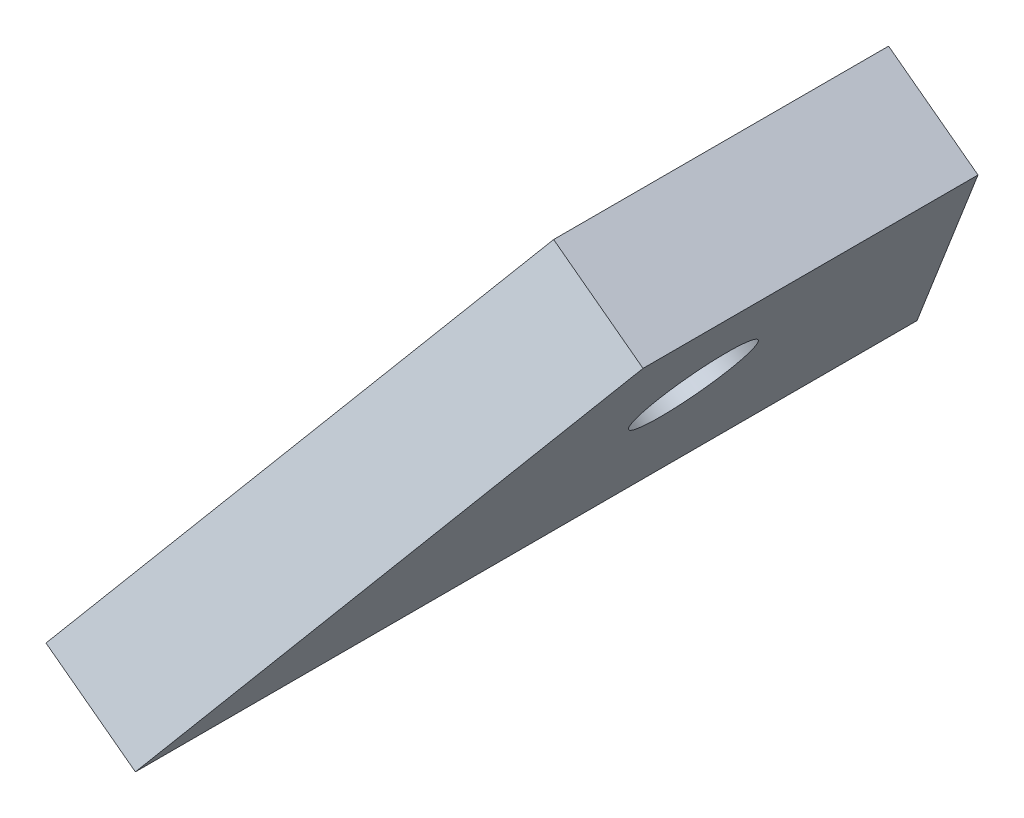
ISO-10303-21;
HEADER;
FILE_DESCRIPTION(('STEP AP214'),'2;1');
FILE_NAME('part.step','',(''),(''),'','','');
FILE_SCHEMA(('AUTOMOTIVE_DESIGN { 1 0 10303 214 1 1 1 1 }'));
ENDSEC;
DATA;
#1=APPLICATION_CONTEXT('core data for automotive mechanical design processes');
#2=APPLICATION_PROTOCOL_DEFINITION('international standard','automotive_design',2000,#1);
#3=PRODUCT_CONTEXT('',#1,'mechanical');
#4=PRODUCT('Part','Part','',(#3));
#5=PRODUCT_RELATED_PRODUCT_CATEGORY('part','',(#4));
#6=PRODUCT_DEFINITION_FORMATION('','',#4);
#7=PRODUCT_DEFINITION_CONTEXT('part definition',#1,'design');
#8=PRODUCT_DEFINITION('design','',#6,#7);
#9=PRODUCT_DEFINITION_SHAPE('','',#8);
#10=(LENGTH_UNIT() NAMED_UNIT(*) SI_UNIT(.MILLI.,.METRE.));
#11=(NAMED_UNIT(*) PLANE_ANGLE_UNIT() SI_UNIT($,.RADIAN.));
#12=(NAMED_UNIT(*) SI_UNIT($,.STERADIAN.) SOLID_ANGLE_UNIT());
#13=UNCERTAINTY_MEASURE_WITH_UNIT(LENGTH_MEASURE(1.E-05),#10,'distance_accuracy_value','');
#14=(GEOMETRIC_REPRESENTATION_CONTEXT(3) GLOBAL_UNCERTAINTY_ASSIGNED_CONTEXT((#13)) GLOBAL_UNIT_ASSIGNED_CONTEXT((#10,
#11,#12)) REPRESENTATION_CONTEXT('',''));
#15=CARTESIAN_POINT('',(0.,0.,0.));
#16=DIRECTION('',(0.,0.,1.));
#17=DIRECTION('',(1.,0.,0.));
#18=AXIS2_PLACEMENT_3D('',#15,#16,#17);
#19=CARTESIAN_POINT('',(-189.838837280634,417.784939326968,-6.));
#20=DIRECTION('',(-0.255106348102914,-0.340916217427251,0.904818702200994));
#21=DIRECTION('',(0.,-0.935780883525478,-0.35258210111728));
#22=AXIS2_PLACEMENT_3D('',#19,#20,#21);
#23=PLANE('',#22);
#24=DIRECTION('',(-0.542100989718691,-0.724446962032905,-0.425797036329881));
#25=VECTOR('',#24,1.);
#26=CARTESIAN_POINT('',(-186.636220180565,415.388432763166,-6.));
#27=LINE('',#26,#25);
#28=CARTESIAN_POINT('',(-186.636220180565,415.388432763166,-6.));
#29=VERTEX_POINT('',#28);
#30=CARTESIAN_POINT('',(-196.82137307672,401.777310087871,-14.));
#31=VERTEX_POINT('',#30);
#32=EDGE_CURVE('E105',#29,#31,#27,.T.);
#33=ORIENTED_EDGE('',*,*,#32,.T.);
#34=DIRECTION('',(0.800654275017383,-0.599126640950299,0.));
#35=VECTOR('',#34,1.);
#36=CARTESIAN_POINT('',(-200.02399017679,404.173816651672,-14.));
#37=LINE('',#36,#35);
#38=CARTESIAN_POINT('',(-200.02399017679,404.173816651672,-14.));
#39=VERTEX_POINT('',#38);
#40=EDGE_CURVE('E12',#39,#31,#37,.T.);
#41=ORIENTED_EDGE('',*,*,#40,.F.);
#42=DIRECTION('',(-0.542100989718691,-0.724446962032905,-0.425797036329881));
#43=VECTOR('',#42,1.);
#44=CARTESIAN_POINT('',(-189.838837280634,417.784939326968,-6.));
#45=LINE('',#44,#43);
#46=CARTESIAN_POINT('',(-189.838837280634,417.784939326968,-6.));
#47=VERTEX_POINT('',#46);
#48=EDGE_CURVE('E92',#47,#39,#45,.T.);
#49=ORIENTED_EDGE('',*,*,#48,.F.);
#50=DIRECTION('',(0.800654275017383,-0.599126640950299,0.));
#51=VECTOR('',#50,1.);
#52=CARTESIAN_POINT('',(-189.838837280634,417.784939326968,-6.));
#53=LINE('',#52,#51);
#54=EDGE_CURVE('E101',#47,#29,#53,.T.);
#55=ORIENTED_EDGE('',*,*,#54,.T.);
#56=EDGE_LOOP('',(#33,#41,#49,#55));
#57=FACE_BOUND('',#56,.T.);
#58=ADVANCED_FACE('F40',(#57),#23,.F.);
#59=CARTESIAN_POINT('',(-200.02399017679,404.173816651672,-14.));
#60=DIRECTION('',(0.599126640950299,0.800654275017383,0.));
#61=DIRECTION('',(-0.800654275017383,0.599126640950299,0.));
#62=AXIS2_PLACEMENT_3D('',#59,#60,#61);
#63=PLANE('',#62);
#64=DIRECTION('',(0.,0.,1.));
#65=VECTOR('',#64,1.);
#66=CARTESIAN_POINT('',(-196.82137307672,401.777310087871,-14.));
#67=LINE('',#66,#65);
#68=CARTESIAN_POINT('',(-196.82137307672,401.777310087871,14.));
#69=VERTEX_POINT('',#68);
#70=EDGE_CURVE('E96',#31,#69,#67,.T.);
#71=ORIENTED_EDGE('',*,*,#70,.T.);
#72=DIRECTION('',(0.800654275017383,-0.599126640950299,0.));
#73=VECTOR('',#72,1.);
#74=CARTESIAN_POINT('',(-200.02399017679,404.173816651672,14.));
#75=LINE('',#74,#73);
#76=CARTESIAN_POINT('',(-200.02399017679,404.173816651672,14.));
#77=VERTEX_POINT('',#76);
#78=EDGE_CURVE('E49',#77,#69,#75,.T.);
#79=ORIENTED_EDGE('',*,*,#78,.F.);
#80=DIRECTION('',(0.,0.,1.));
#81=VECTOR('',#80,1.);
#82=CARTESIAN_POINT('',(-200.02399017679,404.173816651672,-14.));
#83=LINE('',#82,#81);
#84=EDGE_CURVE('E87',#39,#77,#83,.T.);
#85=ORIENTED_EDGE('',*,*,#84,.F.);
#86=ORIENTED_EDGE('',*,*,#40,.T.);
#87=EDGE_LOOP('',(#71,#79,#85,#86));
#88=FACE_BOUND('',#87,.T.);
#89=ADVANCED_FACE('F95',(#88),#63,.F.);
#90=CARTESIAN_POINT('',(-200.02399017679,404.173816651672,14.));
#91=DIRECTION('',(-0.255106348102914,-0.340916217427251,-0.904818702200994));
#92=DIRECTION('',(0.,0.935780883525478,-0.35258210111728));
#93=AXIS2_PLACEMENT_3D('',#90,#91,#92);
#94=PLANE('',#93);
#95=DIRECTION('',(0.542100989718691,0.724446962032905,-0.425797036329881));
#96=VECTOR('',#95,1.);
#97=CARTESIAN_POINT('',(-196.82137307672,401.777310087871,14.));
#98=LINE('',#97,#96);
#99=CARTESIAN_POINT('',(-186.636220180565,415.388432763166,6.));
#100=VERTEX_POINT('',#99);
#101=EDGE_CURVE('E74',#69,#100,#98,.T.);
#102=ORIENTED_EDGE('',*,*,#101,.T.);
#103=DIRECTION('',(0.800654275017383,-0.599126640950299,0.));
#104=VECTOR('',#103,1.);
#105=CARTESIAN_POINT('',(-189.838837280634,417.784939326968,6.));
#106=LINE('',#105,#104);
#107=CARTESIAN_POINT('',(-189.838837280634,417.784939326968,6.));
#108=VERTEX_POINT('',#107);
#109=EDGE_CURVE('E97',#108,#100,#106,.T.);
#110=ORIENTED_EDGE('',*,*,#109,.F.);
#111=DIRECTION('',(0.542100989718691,0.724446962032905,-0.425797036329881));
#112=VECTOR('',#111,1.);
#113=CARTESIAN_POINT('',(-200.02399017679,404.173816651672,14.));
#114=LINE('',#113,#112);
#115=EDGE_CURVE('E90',#77,#108,#114,.T.);
#116=ORIENTED_EDGE('',*,*,#115,.F.);
#117=ORIENTED_EDGE('',*,*,#78,.T.);
#118=EDGE_LOOP('',(#102,#110,#116,#117));
#119=FACE_BOUND('',#118,.T.);
#120=ADVANCED_FACE('F99',(#119),#94,.F.);
#121=CARTESIAN_POINT('',(-189.838837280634,417.784939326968,6.));
#122=DIRECTION('',(-0.599126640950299,-0.800654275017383,0.));
#123=DIRECTION('',(0.800654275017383,-0.599126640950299,0.));
#124=AXIS2_PLACEMENT_3D('',#121,#122,#123);
#125=PLANE('',#124);
#126=DIRECTION('',(0.,0.,-1.));
#127=VECTOR('',#126,1.);
#128=CARTESIAN_POINT('',(-186.636220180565,415.388432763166,6.));
#129=LINE('',#128,#127);
#130=EDGE_CURVE('E80',#100,#29,#129,.T.);
#131=ORIENTED_EDGE('',*,*,#130,.T.);
#132=ORIENTED_EDGE('',*,*,#54,.F.);
#133=DIRECTION('',(0.,0.,-1.));
#134=VECTOR('',#133,1.);
#135=CARTESIAN_POINT('',(-189.838837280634,417.784939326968,6.));
#136=LINE('',#135,#134);
#137=EDGE_CURVE('E57',#108,#47,#136,.T.);
#138=ORIENTED_EDGE('',*,*,#137,.F.);
#139=ORIENTED_EDGE('',*,*,#109,.T.);
#140=EDGE_LOOP('',(#131,#132,#138,#139));
#141=FACE_BOUND('',#140,.T.);
#142=ADVANCED_FACE('F113',(#141),#125,.F.);
#143=CARTESIAN_POINT('',(-322.104306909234,241.029464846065,0.));
#144=DIRECTION('',(-0.800654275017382,0.5991266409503,0.));
#145=DIRECTION('',(-0.5991266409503,-0.800654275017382,0.));
#146=AXIS2_PLACEMENT_3D('',#143,#144,#145);
#147=PLANE('',#146);
#148=CARTESIAN_POINT('',(-194.032723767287,412.180359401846,0.));
#149=DIRECTION('',(-0.800654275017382,0.5991266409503,0.));
#150=DIRECTION('',(-0.5991266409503,-0.800654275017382,0.));
#151=AXIS2_PLACEMENT_3D('',#148,#149,#150);
#152=CIRCLE('',#151,2.);
#153=CARTESIAN_POINT('',(-195.230977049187,410.579050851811,0.));
#154=VERTEX_POINT('',#153);
#155=EDGE_CURVE('E108',#154,#154,#152,.T.);
#156=ORIENTED_EDGE('',*,*,#155,.F.);
#157=EDGE_LOOP('',(#156));
#158=FACE_BOUND('',#157,.T.);
#159=ORIENTED_EDGE('',*,*,#48,.T.);
#160=ORIENTED_EDGE('',*,*,#84,.T.);
#161=ORIENTED_EDGE('',*,*,#115,.T.);
#162=ORIENTED_EDGE('',*,*,#137,.T.);
#163=EDGE_LOOP('',(#159,#160,#161,#162));
#164=FACE_BOUND('',#163,.T.);
#165=ADVANCED_FACE('F88',(#158,#164),#147,.T.);
#166=CARTESIAN_POINT('',(-318.901689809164,238.632958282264,0.));
#167=DIRECTION('',(-0.800654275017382,0.5991266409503,0.));
#168=DIRECTION('',(-0.5991266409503,-0.800654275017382,0.));
#169=AXIS2_PLACEMENT_3D('',#166,#167,#168);
#170=PLANE('',#169);
#171=CARTESIAN_POINT('',(-190.830106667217,409.783852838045,0.));
#172=DIRECTION('',(-0.800654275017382,0.5991266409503,0.));
#173=DIRECTION('',(-0.5991266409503,-0.800654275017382,0.));
#174=AXIS2_PLACEMENT_3D('',#171,#172,#173);
#175=CIRCLE('',#174,2.);
#176=CARTESIAN_POINT('',(-192.028359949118,408.18254428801,0.));
#177=VERTEX_POINT('',#176);
#178=EDGE_CURVE('E43',#177,#177,#175,.T.);
#179=ORIENTED_EDGE('',*,*,#178,.T.);
#180=EDGE_LOOP('',(#179));
#181=FACE_BOUND('',#180,.T.);
#182=ORIENTED_EDGE('',*,*,#32,.F.);
#183=ORIENTED_EDGE('',*,*,#130,.F.);
#184=ORIENTED_EDGE('',*,*,#101,.F.);
#185=ORIENTED_EDGE('',*,*,#70,.F.);
#186=EDGE_LOOP('',(#182,#183,#184,#185));
#187=FACE_BOUND('',#186,.T.);
#188=ADVANCED_FACE('F116',(#181,#187),#170,.F.);
#189=CARTESIAN_POINT('',(-190.0294523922,409.184726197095,0.));
#190=DIRECTION('',(-0.800654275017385,0.599126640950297,0.));
#191=DIRECTION('',(-0.599126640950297,-0.800654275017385,0.));
#192=AXIS2_PLACEMENT_3D('',#189,#190,#191);
#193=CYLINDRICAL_SURFACE('',#192,2.);
#194=ORIENTED_EDGE('',*,*,#155,.T.);
#195=EDGE_LOOP('',(#194));
#196=FACE_BOUND('',#195,.T.);
#197=ORIENTED_EDGE('',*,*,#178,.F.);
#198=EDGE_LOOP('',(#197));
#199=FACE_BOUND('',#198,.T.);
#200=ADVANCED_FACE('F126',(#196,#199),#193,.F.);
#201=CLOSED_SHELL('',(#58,#89,#120,#142,#165,#188,#200));
#202=MANIFOLD_SOLID_BREP('B2',#201);
#203=ADVANCED_BREP_SHAPE_REPRESENTATION('',(#18,#202),#14);
#204=SHAPE_DEFINITION_REPRESENTATION(#9,#203);
ENDSEC;
END-ISO-10303-21;
